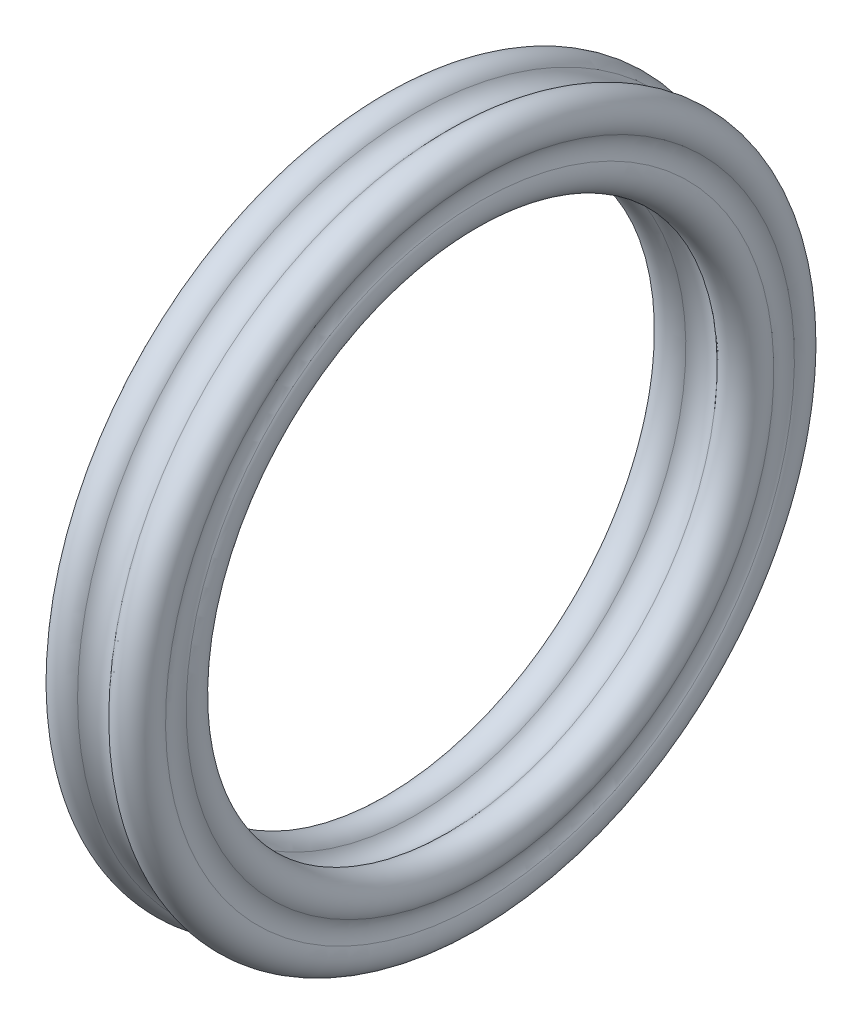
ISO-10303-21;
HEADER;
FILE_DESCRIPTION(('STEP AP214'),'2;1');
FILE_NAME('part.step','',(''),(''),'','','');
FILE_SCHEMA(('AUTOMOTIVE_DESIGN { 1 0 10303 214 1 1 1 1 }'));
ENDSEC;
DATA;
#1=APPLICATION_CONTEXT('core data for automotive mechanical design processes');
#2=APPLICATION_PROTOCOL_DEFINITION('international standard','automotive_design',2000,#1);
#3=PRODUCT_CONTEXT('',#1,'mechanical');
#4=PRODUCT('Part','Part','',(#3));
#5=PRODUCT_RELATED_PRODUCT_CATEGORY('part','',(#4));
#6=PRODUCT_DEFINITION_FORMATION('','',#4);
#7=PRODUCT_DEFINITION_CONTEXT('part definition',#1,'design');
#8=PRODUCT_DEFINITION('design','',#6,#7);
#9=PRODUCT_DEFINITION_SHAPE('','',#8);
#10=(LENGTH_UNIT() NAMED_UNIT(*) SI_UNIT(.MILLI.,.METRE.));
#11=(NAMED_UNIT(*) PLANE_ANGLE_UNIT() SI_UNIT($,.RADIAN.));
#12=(NAMED_UNIT(*) SI_UNIT($,.STERADIAN.) SOLID_ANGLE_UNIT());
#13=UNCERTAINTY_MEASURE_WITH_UNIT(LENGTH_MEASURE(1.E-05),#10,'distance_accuracy_value','');
#14=(GEOMETRIC_REPRESENTATION_CONTEXT(3) GLOBAL_UNCERTAINTY_ASSIGNED_CONTEXT((#13)) GLOBAL_UNIT_ASSIGNED_CONTEXT((#10,
#11,#12)) REPRESENTATION_CONTEXT('',''));
#15=CARTESIAN_POINT('',(0.,0.,0.));
#16=DIRECTION('',(0.,0.,1.));
#17=DIRECTION('',(1.,0.,0.));
#18=AXIS2_PLACEMENT_3D('',#15,#16,#17);
#19=CARTESIAN_POINT('',(18.2705573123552,0.,0.));
#20=DIRECTION('',(-1.,0.,0.));
#21=DIRECTION('',(0.,-1.,0.));
#22=AXIS2_PLACEMENT_3D('',#19,#20,#21);
#23=TOROIDAL_SURFACE('',#22,8.8125,0.590997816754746);
#24=CARTESIAN_POINT('',(18.780777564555,0.,0.));
#25=DIRECTION('',(-1.,0.,0.));
#26=DIRECTION('',(0.,-1.,0.));
#27=AXIS2_PLACEMENT_3D('',#24,#25,#26);
#28=CIRCLE('',#27,8.51424890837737);
#29=CARTESIAN_POINT('',(18.780777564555,-8.51424890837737,0.));
#30=VERTEX_POINT('',#29);
#31=EDGE_CURVE('E10',#30,#30,#28,.T.);
#32=ORIENTED_EDGE('',*,*,#31,.F.);
#33=EDGE_LOOP('',(#32));
#34=FACE_BOUND('',#33,.T.);
#35=CARTESIAN_POINT('',(18.780777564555,0.,0.));
#36=DIRECTION('',(-1.,0.,0.));
#37=DIRECTION('',(0.,-1.,0.));
#38=AXIS2_PLACEMENT_3D('',#35,#36,#37);
#39=CIRCLE('',#38,9.11075109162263);
#40=CARTESIAN_POINT('',(18.780777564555,-9.11075109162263,0.));
#41=VERTEX_POINT('',#40);
#42=EDGE_CURVE('E376',#41,#41,#39,.T.);
#43=ORIENTED_EDGE('',*,*,#42,.T.);
#44=EDGE_LOOP('',(#43));
#45=FACE_BOUND('',#44,.T.);
#46=ADVANCED_FACE('F348',(#34,#45),#23,.F.);
#47=CARTESIAN_POINT('',(19.2909978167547,0.,0.));
#48=DIRECTION('',(-1.,0.,0.));
#49=DIRECTION('',(0.,-1.,0.));
#50=AXIS2_PLACEMENT_3D('',#47,#48,#49);
#51=TOROIDAL_SURFACE('',#50,8.21599781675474,0.590997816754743);
#52=CARTESIAN_POINT('',(19.7454989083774,0.,0.));
#53=DIRECTION('',(-1.,0.,0.));
#54=DIRECTION('',(0.,-1.,0.));
#55=AXIS2_PLACEMENT_3D('',#52,#53,#54);
#56=CIRCLE('',#55,7.83823178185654);
#57=CARTESIAN_POINT('',(19.7454989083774,-7.83823178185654,0.));
#58=VERTEX_POINT('',#57);
#59=EDGE_CURVE('E354',#58,#58,#56,.T.);
#60=ORIENTED_EDGE('',*,*,#59,.F.);
#61=EDGE_LOOP('',(#60));
#62=FACE_BOUND('',#61,.T.);
#63=ORIENTED_EDGE('',*,*,#31,.T.);
#64=EDGE_LOOP('',(#63));
#65=FACE_BOUND('',#64,.T.);
#66=ADVANCED_FACE('F413',(#62,#65),#51,.T.);
#67=CARTESIAN_POINT('',(20.2,0.,0.));
#68=DIRECTION('',(-1.,0.,0.));
#69=DIRECTION('',(0.,-1.,0.));
#70=AXIS2_PLACEMENT_3D('',#67,#68,#69);
#71=TOROIDAL_SURFACE('',#70,7.46046574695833,0.590997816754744);
#72=CARTESIAN_POINT('',(20.6545010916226,0.,0.));
#73=DIRECTION('',(-1.,0.,0.));
#74=DIRECTION('',(0.,-1.,0.));
#75=AXIS2_PLACEMENT_3D('',#72,#73,#74);
#76=CIRCLE('',#75,7.83823178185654);
#77=CARTESIAN_POINT('',(20.6545010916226,-7.83823178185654,0.));
#78=VERTEX_POINT('',#77);
#79=EDGE_CURVE('E358',#78,#78,#76,.T.);
#80=ORIENTED_EDGE('',*,*,#79,.F.);
#81=EDGE_LOOP('',(#80));
#82=FACE_BOUND('',#81,.T.);
#83=ORIENTED_EDGE('',*,*,#59,.T.);
#84=EDGE_LOOP('',(#83));
#85=FACE_BOUND('',#84,.T.);
#86=ADVANCED_FACE('F408',(#82,#85),#71,.F.);
#87=CARTESIAN_POINT('',(21.1090021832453,0.,0.));
#88=DIRECTION('',(-1.,0.,0.));
#89=DIRECTION('',(0.,-1.,0.));
#90=AXIS2_PLACEMENT_3D('',#87,#88,#89);
#91=TOROIDAL_SURFACE('',#90,8.21599781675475,0.590997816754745);
#92=CARTESIAN_POINT('',(21.619222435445,0.,0.));
#93=DIRECTION('',(-1.,0.,0.));
#94=DIRECTION('',(0.,-1.,0.));
#95=AXIS2_PLACEMENT_3D('',#92,#93,#94);
#96=CIRCLE('',#95,8.51424890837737);
#97=CARTESIAN_POINT('',(21.619222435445,-8.51424890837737,0.));
#98=VERTEX_POINT('',#97);
#99=EDGE_CURVE('E362',#98,#98,#96,.T.);
#100=ORIENTED_EDGE('',*,*,#99,.F.);
#101=EDGE_LOOP('',(#100));
#102=FACE_BOUND('',#101,.T.);
#103=ORIENTED_EDGE('',*,*,#79,.T.);
#104=EDGE_LOOP('',(#103));
#105=FACE_BOUND('',#104,.T.);
#106=ADVANCED_FACE('F402',(#102,#105),#91,.T.);
#107=CARTESIAN_POINT('',(22.1294426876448,0.,0.));
#108=DIRECTION('',(-1.,0.,0.));
#109=DIRECTION('',(0.,-1.,0.));
#110=AXIS2_PLACEMENT_3D('',#107,#108,#109);
#111=TOROIDAL_SURFACE('',#110,8.8125,0.590997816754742);
#112=CARTESIAN_POINT('',(21.619222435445,0.,0.));
#113=DIRECTION('',(-1.,0.,0.));
#114=DIRECTION('',(0.,-1.,0.));
#115=AXIS2_PLACEMENT_3D('',#112,#113,#114);
#116=CIRCLE('',#115,9.11075109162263);
#117=CARTESIAN_POINT('',(21.619222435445,-9.11075109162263,0.));
#118=VERTEX_POINT('',#117);
#119=EDGE_CURVE('E367',#118,#118,#116,.T.);
#120=ORIENTED_EDGE('',*,*,#119,.F.);
#121=EDGE_LOOP('',(#120));
#122=FACE_BOUND('',#121,.T.);
#123=ORIENTED_EDGE('',*,*,#99,.T.);
#124=EDGE_LOOP('',(#123));
#125=FACE_BOUND('',#124,.T.);
#126=ADVANCED_FACE('F396',(#122,#125),#111,.F.);
#127=CARTESIAN_POINT('',(21.1090021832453,0.,0.));
#128=DIRECTION('',(-1.,0.,0.));
#129=DIRECTION('',(0.,-1.,0.));
#130=AXIS2_PLACEMENT_3D('',#127,#128,#129);
#131=TOROIDAL_SURFACE('',#130,9.40900218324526,0.590997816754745);
#132=CARTESIAN_POINT('',(20.6545010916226,0.,0.));
#133=DIRECTION('',(-1.,0.,0.));
#134=DIRECTION('',(0.,-1.,0.));
#135=AXIS2_PLACEMENT_3D('',#132,#133,#134);
#136=CIRCLE('',#135,9.78676821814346);
#137=CARTESIAN_POINT('',(20.6545010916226,-9.78676821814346,0.));
#138=VERTEX_POINT('',#137);
#139=EDGE_CURVE('E370',#138,#138,#136,.T.);
#140=ORIENTED_EDGE('',*,*,#139,.F.);
#141=EDGE_LOOP('',(#140));
#142=FACE_BOUND('',#141,.T.);
#143=ORIENTED_EDGE('',*,*,#119,.T.);
#144=EDGE_LOOP('',(#143));
#145=FACE_BOUND('',#144,.T.);
#146=ADVANCED_FACE('F390',(#142,#145),#131,.T.);
#147=CARTESIAN_POINT('',(20.2,0.,0.));
#148=DIRECTION('',(-1.,0.,0.));
#149=DIRECTION('',(0.,-1.,0.));
#150=AXIS2_PLACEMENT_3D('',#147,#148,#149);
#151=TOROIDAL_SURFACE('',#150,10.1645342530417,0.590997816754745);
#152=CARTESIAN_POINT('',(19.7454989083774,0.,0.));
#153=DIRECTION('',(-1.,0.,0.));
#154=DIRECTION('',(0.,-1.,0.));
#155=AXIS2_PLACEMENT_3D('',#152,#153,#154);
#156=CIRCLE('',#155,9.78676821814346);
#157=CARTESIAN_POINT('',(19.7454989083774,-9.78676821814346,0.));
#158=VERTEX_POINT('',#157);
#159=EDGE_CURVE('E373',#158,#158,#156,.T.);
#160=ORIENTED_EDGE('',*,*,#159,.F.);
#161=EDGE_LOOP('',(#160));
#162=FACE_BOUND('',#161,.T.);
#163=ORIENTED_EDGE('',*,*,#139,.T.);
#164=EDGE_LOOP('',(#163));
#165=FACE_BOUND('',#164,.T.);
#166=ADVANCED_FACE('F384',(#162,#165),#151,.F.);
#167=CARTESIAN_POINT('',(19.2909978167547,0.,0.));
#168=DIRECTION('',(-1.,0.,0.));
#169=DIRECTION('',(0.,-1.,0.));
#170=AXIS2_PLACEMENT_3D('',#167,#168,#169);
#171=TOROIDAL_SURFACE('',#170,9.40900218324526,0.590997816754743);
#172=ORIENTED_EDGE('',*,*,#42,.F.);
#173=EDGE_LOOP('',(#172));
#174=FACE_BOUND('',#173,.T.);
#175=ORIENTED_EDGE('',*,*,#159,.T.);
#176=EDGE_LOOP('',(#175));
#177=FACE_BOUND('',#176,.T.);
#178=ADVANCED_FACE('F381',(#174,#177),#171,.T.);
#179=CLOSED_SHELL('',(#46,#66,#86,#106,#126,#146,#166,#178));
#180=MANIFOLD_SOLID_BREP('B2',#179);
#181=ADVANCED_BREP_SHAPE_REPRESENTATION('',(#18,#180),#14);
#182=SHAPE_DEFINITION_REPRESENTATION(#9,#181);
ENDSEC;
END-ISO-10303-21;
